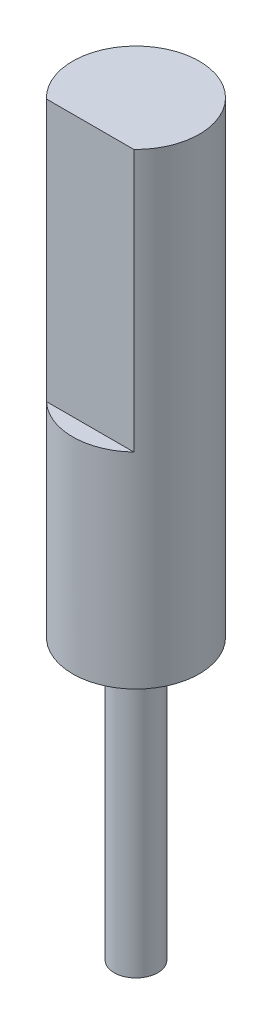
from build123d import *

# Parameters (mm, degrees)
CROQUIS1_R              = 1.45
SALIENTE_EXTRUIR1_DEPTH = 10.7
CORTAR_EXTRUIR1_START   = -6
CORTAR_EXTRUIR1_DEPTH   = 6
CROQUIS3_R              = 0.5
SALIENTE_EXTRUIR2_DEPTH = 6.4


with BuildPart() as part:
    # Croquis1 → Saliente-Extruir1 (new body)
    with BuildSketch(Plane(origin=(0, 0, 0), x_dir=(1, 0, 0), z_dir=(0, 1, 0))):
        with Locations(Location((0, 0, 0), (0, 0, 270))):
            Circle(CROQUIS1_R)
    extrude(amount=SALIENTE_EXTRUIR1_DEPTH)

    # Croquis2 → Cortar-Extruir1 (cut)
    with BuildSketch(Plane(origin=(0, 10.7, 0), x_dir=(1, 0, 0), z_dir=(0, 1, 0)).offset(CORTAR_EXTRUIR1_START)):
        with BuildLine():
            Line((-1, -1.05), (1, -1.05))
            ThreePointArc((1, -1.05), (0, -1.45), (-1, -1.05))
        make_face()
    extrude(amount=CORTAR_EXTRUIR1_DEPTH, mode=Mode.SUBTRACT)

    # Croquis3 → Saliente-Extruir2 (add)
    with BuildSketch(Plane.XZ):
        with Locations(Location((0, 0, 0), (0, 0, 270))):
            Circle(CROQUIS3_R)
    extrude(amount=SALIENTE_EXTRUIR2_DEPTH)


solid = part.part
